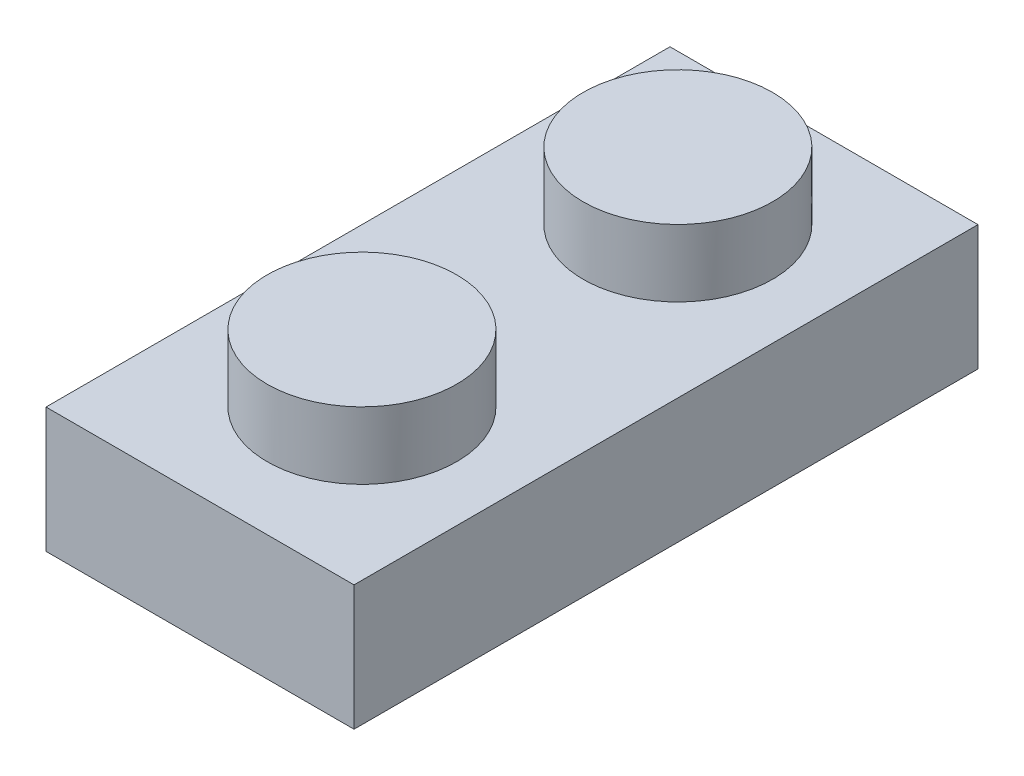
from build123d import *

# Parameters (mm, degrees)
SKETCH1_W       = 7.8
SKETCH1_H       = 15.8
EXTRUDE1_DEPTH  = 3.166
SKETCH2_R       = 2.4
EXTRUDE2_DEPTH  = 1.7
SKETCH3_W       = 4.9
SKETCH3_H       = 4.9
EXTRUDE3_DEPTH  = 2.5
LPATTERN1_COUNT = 2
LPATTERN1_PITCH = 8
LPATTERN2_COUNT = 2
LPATTERN2_PITCH = 8


with BuildPart() as part:
    # Sketch1 → Extrude1 (new body)
    with BuildSketch(Plane(origin=(0, 0, 0), x_dir=(1, 0, 0), z_dir=(0, 1, 0))):
        with Locations((3.9, 7.9)):
            Rectangle(SKETCH1_W, SKETCH1_H)
    extrude(amount=EXTRUDE1_DEPTH)

    # Sketch2 → Extrude2 (add)
    with BuildSketch(Plane(origin=(0, 3.166, 0), x_dir=(1, 0, 0), z_dir=(0, 1, 0))):
        with Locations(Location((4, 4, 0), (0, 0, 90))):
            Circle(SKETCH2_R)
    extrude2 = extrude(amount=EXTRUDE2_DEPTH)

    # Sketch3 → Extrude3 (cut)
    with BuildSketch(Plane.XZ):
        with Locations((3.9, -11.9)):
            Rectangle(SKETCH3_W, SKETCH3_H)
    extrude3 = extrude(amount=-EXTRUDE3_DEPTH, mode=Mode.SUBTRACT)

    # LPattern1: Extrude2 ×2
    with Locations(*[(0, 0, -i * LPATTERN1_PITCH) for i in range(1, LPATTERN1_COUNT)]):
        add(extrude2)

    # LPattern2: Extrude3 ×2
    with Locations(*[(0, 0, i * LPATTERN2_PITCH) for i in range(1, LPATTERN2_COUNT)]):
        add(extrude3, mode=Mode.SUBTRACT)


solid = part.part
